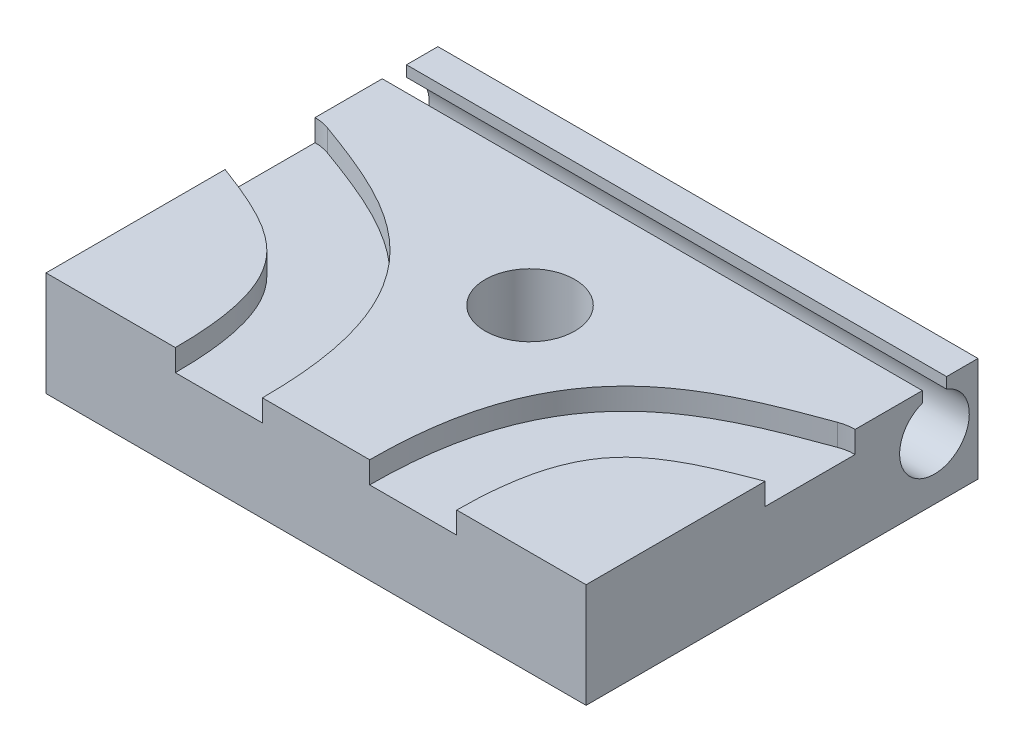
from build123d import *

# Parameters (mm, degrees)
BOSS_EXTRUDE1_DEPTH      = 9.845
BOSS_EXTRUDE1_DEPTH_BACK = 9.845
SKETCH1_R                = 1.27
F_4_CLEARANCE_HOLE1_D    = 3.2639
SKETCH6_W                = 19.69
SKETCH6_H                = 11.1125
CUT_EXTRUDE3_DEPTH       = 17.514542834
SKETCH7_W                = 0.883882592
SKETCH7_H                = 0.79375
CUT_EXTRUDE4_DEPTH       = 24.73820128
CUT_EXTRUDE5_DEPTH       = 0.79375


with BuildPart() as part:
    # Sketch1 → Boss-Extrude1 (new, two sides: drawn at the far end of the back side and taken through both)
    with BuildSketch(Plane(origin=(0, 0, 0), x_dir=(0, 0, -1), z_dir=(1, 0, 0)).offset(-BOSS_EXTRUDE1_DEPTH_BACK)):
        Polygon((-12.7, 0), (0, 0), (12.7, 0), (12.7, -3.81), (-12.7, -3.81), align=None)
        with Locations((0, -1.5875)):
            Circle(SKETCH1_R, mode=Mode.SUBTRACT)
    extrude(amount=BOSS_EXTRUDE1_DEPTH + BOSS_EXTRUDE1_DEPTH_BACK)

    # 4 Clearance Hole1 (through all)
    with Locations(Plane(origin=(0, 0, 0), x_dir=(-1, 0, 0), z_dir=(0, 1, 0))):
        with Locations((0, -7.9375), (0, 4.9)):
            Hole(F_4_CLEARANCE_HOLE1_D / 2)

    # Sketch6 → Cut-Extrude3 (cut, through all)
    with BuildSketch(Plane(origin=(0, 0, 0), x_dir=(1, 0, 0), z_dir=(0, 1, 0))):
        with Locations((0, 7.14375)):
            Rectangle(SKETCH6_W, SKETCH6_H)
    extrude(amount=-CUT_EXTRUDE3_DEPTH, mode=Mode.SUBTRACT)

    # Sketch7 → Cut-Extrude4 (cut, through all)
    with BuildSketch(Plane(origin=(9.845, 0, 0), x_dir=(0, 0, -1), z_dir=(1, 0, 0))):
        Rectangle(SKETCH7_W, SKETCH7_H)
    extrude(amount=-CUT_EXTRUDE4_DEPTH, mode=Mode.SUBTRACT)

    # Sketch8 → Cut-Extrude5 (cut)
    with BuildSketch(Plane(origin=(0, 0, 0), x_dir=(1, 0, 0), z_dir=(0, 1, 0))):
        with BuildLine():
            ThreePointArc((-10.387956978, -5.970197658), (-11.336762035, -3.935478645), (-9.302043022, -2.986673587))
            add(Edge.make_bspline(
                [(-9.302043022, -2.986673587), (-8.384619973, -3.320588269), (-7.007022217, -3.833235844), (-5.308225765, -4.810503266), (-4.132780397, -5.78990455), (-3.151945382, -7.072220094), (-2.450429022, -8.642723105), (-2.11081604, -10.184385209), (-1.976689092, -11.55614785), (-1.954496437, -12.325506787), (-1.954496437, -12.7)],
                knots=[0, 0, 0, 0, 0.25, 0.375, 0.5, 0.625, 0.75, 0.875, 0.9375, 1, 1, 1, 1], degree=3))
            ThreePointArc((-1.954496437, -12.7), (-3.541996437, -14.2875), (-5.129496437, -12.7))
            add(Edge.make_bspline(
                [(-10.387956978, -5.970197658), (-10.167275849, -6.05051902), (-9.716673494, -6.215944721), (-8.898003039, -6.532035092), (-7.986046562, -6.932101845), (-7.108865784, -7.444953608), (-6.437222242, -8.013525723), (-5.916946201, -8.693196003), (-5.498748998, -9.605960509), (-5.254039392, -10.681628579), (-5.14830183, -11.744948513), (-5.129496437, -12.391052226), (-5.129496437, -12.7)],
                knots=[0, 0, 0, 0, 0.0625, 0.125, 0.25, 0.375, 0.5, 0.625, 0.75, 0.875, 0.9375, 1, 1, 1, 1], degree=3))
        make_face()
        with BuildLine():
            ThreePointArc((5.129496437, -12.7), (3.541996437, -14.2875), (1.954496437, -12.7))
            add(Edge.make_bspline(
                [(9.302043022, -2.986673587), (8.384619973, -3.320588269), (7.007022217, -3.833235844), (5.308225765, -4.810503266), (4.132780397, -5.78990455), (3.151945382, -7.072220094), (2.450429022, -8.642723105), (2.11081604, -10.184385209), (1.976689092, -11.55614785), (1.954496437, -12.325506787), (1.954496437, -12.7)],
                knots=[0, 0, 0, 0, 0.25, 0.375, 0.5, 0.625, 0.75, 0.875, 0.9375, 1, 1, 1, 1], degree=3))
            ThreePointArc((9.302043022, -2.986673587), (11.336762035, -3.935478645), (10.387956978, -5.970197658))
            add(Edge.make_bspline(
                [(10.387956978, -5.970197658), (10.167275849, -6.05051902), (9.716673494, -6.215944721), (8.898003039, -6.532035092), (7.986046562, -6.932101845), (7.108865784, -7.444953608), (6.437222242, -8.013525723), (5.916946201, -8.693196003), (5.498748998, -9.605960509), (5.254039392, -10.681628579), (5.14830183, -11.744948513), (5.129496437, -12.391052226), (5.129496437, -12.7)],
                knots=[0, 0, 0, 0, 0.0625, 0.125, 0.25, 0.375, 0.5, 0.625, 0.75, 0.875, 0.9375, 1, 1, 1, 1], degree=3))
        make_face()
    extrude(amount=-CUT_EXTRUDE5_DEPTH, mode=Mode.SUBTRACT)


solid = part.part
